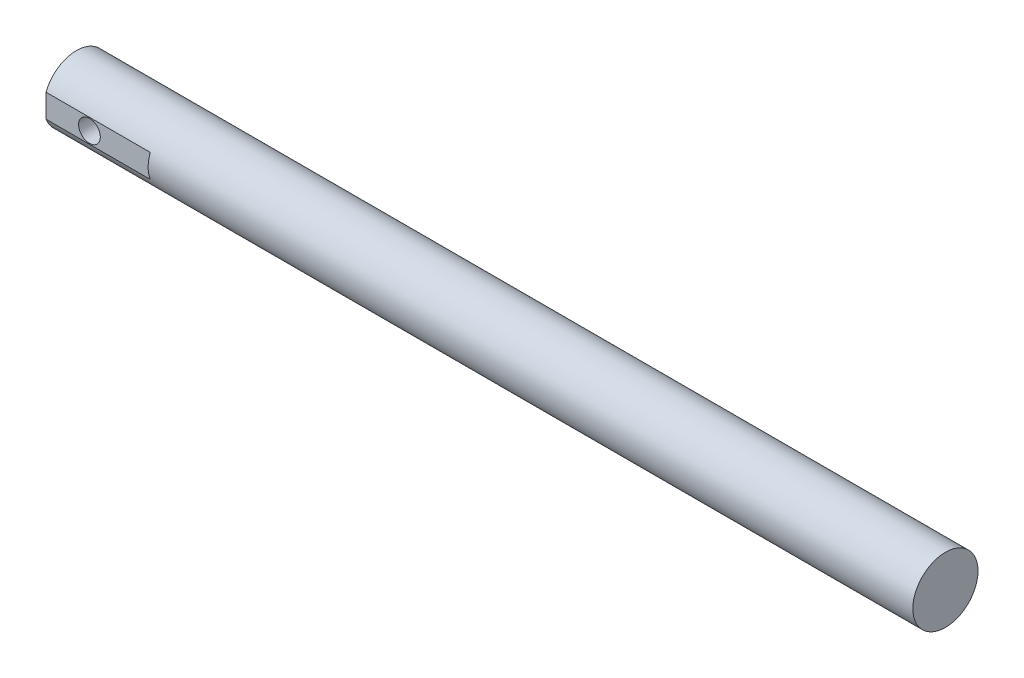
from build123d import *

# Parameters (mm, degrees)
SKETCH1_R           = 4.7625
BOSS_EXTRUDE1_DEPTH = 127
CUT_EXTRUDE1_DEPTH  = 15.24
SKETCH3_R           = 1.5875
CUT_EXTRUDE2_DEPTH  = 128.422366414


with BuildPart() as part:
    # Sketch1 → Boss-Extrude1 (new body)
    with BuildSketch(Plane(origin=(0, 0, 0), x_dir=(0, 0, -1), z_dir=(1, 0, 0))):
        Circle(SKETCH1_R)
    extrude(amount=BOSS_EXTRUDE1_DEPTH)

    # Sketch2 → Cut-Extrude1 (cut)
    with BuildSketch(Plane.ZY):
        with BuildLine():
            ThreePointArc((4.7625, 0), (4.682452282, 0.86950956), (4.445, 1.709789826))
            Line((4.445, 1.709789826), (4.445, -1.709789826))
            ThreePointArc((4.445, -1.709789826), (4.682452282, -0.86950956), (4.7625, 0))
        make_face()
        with BuildLine():
            Line((-4.445, -1.709789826), (-4.445, 1.709789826))
            ThreePointArc((-4.445, 1.709789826), (-4.7625, 0), (-4.445, -1.709789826))
        make_face()
    extrude(amount=-CUT_EXTRUDE1_DEPTH, mode=Mode.SUBTRACT)

    # Sketch3 → Cut-Extrude2 (cut, through all)
    with BuildSketch(Plane.XY.offset(4.445)):
        with Locations((6.35, 0)):
            Circle(SKETCH3_R)
    extrude(amount=-CUT_EXTRUDE2_DEPTH, mode=Mode.SUBTRACT)


solid = part.part
